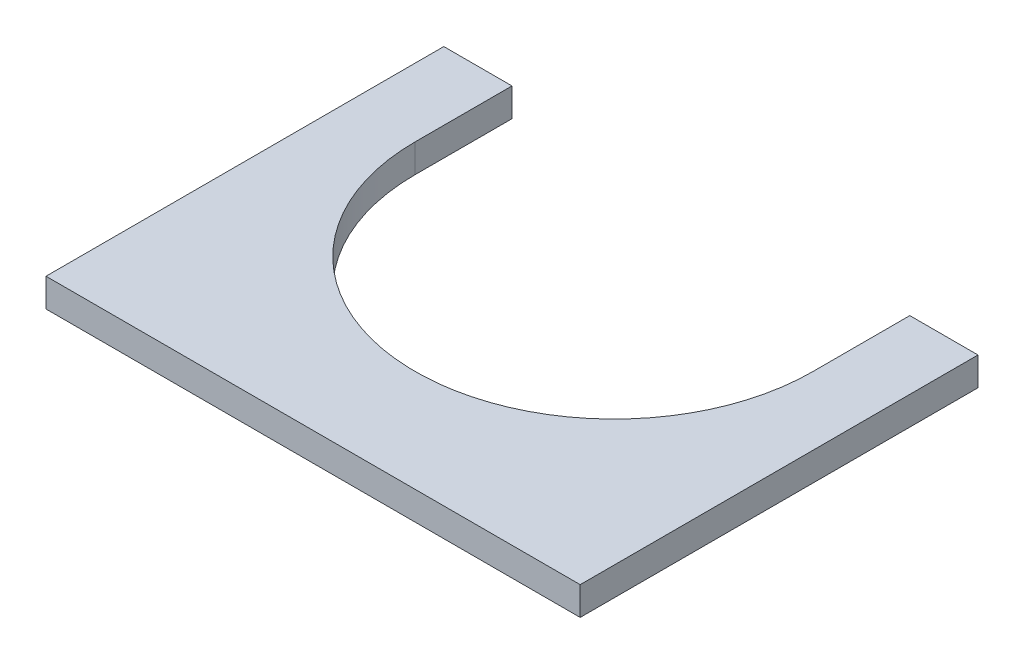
ISO-10303-21;
HEADER;
FILE_DESCRIPTION(('STEP AP214'),'2;1');
FILE_NAME('part.step','',(''),(''),'','','');
FILE_SCHEMA(('AUTOMOTIVE_DESIGN { 1 0 10303 214 1 1 1 1 }'));
ENDSEC;
DATA;
#1=APPLICATION_CONTEXT('core data for automotive mechanical design processes');
#2=APPLICATION_PROTOCOL_DEFINITION('international standard','automotive_design',2000,#1);
#3=PRODUCT_CONTEXT('',#1,'mechanical');
#4=PRODUCT('Part','Part','',(#3));
#5=PRODUCT_RELATED_PRODUCT_CATEGORY('part','',(#4));
#6=PRODUCT_DEFINITION_FORMATION('','',#4);
#7=PRODUCT_DEFINITION_CONTEXT('part definition',#1,'design');
#8=PRODUCT_DEFINITION('design','',#6,#7);
#9=PRODUCT_DEFINITION_SHAPE('','',#8);
#10=(LENGTH_UNIT() NAMED_UNIT(*) SI_UNIT(.MILLI.,.METRE.));
#11=(NAMED_UNIT(*) PLANE_ANGLE_UNIT() SI_UNIT($,.RADIAN.));
#12=(NAMED_UNIT(*) SI_UNIT($,.STERADIAN.) SOLID_ANGLE_UNIT());
#13=UNCERTAINTY_MEASURE_WITH_UNIT(LENGTH_MEASURE(1.E-05),#10,'distance_accuracy_value','');
#14=(GEOMETRIC_REPRESENTATION_CONTEXT(3) GLOBAL_UNCERTAINTY_ASSIGNED_CONTEXT((#13)) GLOBAL_UNIT_ASSIGNED_CONTEXT((#10,
#11,#12)) REPRESENTATION_CONTEXT('',''));
#15=CARTESIAN_POINT('',(0.,0.,0.));
#16=DIRECTION('',(0.,0.,1.));
#17=DIRECTION('',(1.,0.,0.));
#18=AXIS2_PLACEMENT_3D('',#15,#16,#17);
#19=CARTESIAN_POINT('',(47.,-5.,-12.5000000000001));
#20=DIRECTION('',(1.,0.,0.));
#21=DIRECTION('',(0.,0.,-1.));
#22=AXIS2_PLACEMENT_3D('',#19,#20,#21);
#23=PLANE('',#22);
#24=DIRECTION('',(0.,0.,-1.));
#25=VECTOR('',#24,1.);
#26=CARTESIAN_POINT('',(47.,0.,-12.5000000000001));
#27=LINE('',#26,#25);
#28=CARTESIAN_POINT('',(47.,0.,57.5));
#29=VERTEX_POINT('',#28);
#30=CARTESIAN_POINT('',(47.,0.,-12.5000000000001));
#31=VERTEX_POINT('',#30);
#32=EDGE_CURVE('E131',#29,#31,#27,.T.);
#33=ORIENTED_EDGE('',*,*,#32,.F.);
#34=DIRECTION('',(0.,1.,0.));
#35=VECTOR('',#34,1.);
#36=CARTESIAN_POINT('',(47.,-5.,57.5));
#37=LINE('',#36,#35);
#38=CARTESIAN_POINT('',(47.,-5.,57.5));
#39=VERTEX_POINT('',#38);
#40=EDGE_CURVE('E11',#39,#29,#37,.T.);
#41=ORIENTED_EDGE('',*,*,#40,.F.);
#42=DIRECTION('',(0.,0.,-1.));
#43=VECTOR('',#42,1.);
#44=CARTESIAN_POINT('',(47.,-5.,-12.5000000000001));
#45=LINE('',#44,#43);
#46=CARTESIAN_POINT('',(47.,-5.,-12.5000000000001));
#47=VERTEX_POINT('',#46);
#48=EDGE_CURVE('E151',#39,#47,#45,.T.);
#49=ORIENTED_EDGE('',*,*,#48,.T.);
#50=DIRECTION('',(0.,1.,0.));
#51=VECTOR('',#50,1.);
#52=CARTESIAN_POINT('',(47.,-5.,-12.5000000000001));
#53=LINE('',#52,#51);
#54=EDGE_CURVE('E37',#47,#31,#53,.T.);
#55=ORIENTED_EDGE('',*,*,#54,.T.);
#56=EDGE_LOOP('',(#33,#41,#49,#55));
#57=FACE_BOUND('',#56,.T.);
#58=ADVANCED_FACE('F34',(#57),#23,.T.);
#59=CARTESIAN_POINT('',(-47.,-5.,57.5));
#60=DIRECTION('',(0.,0.,1.));
#61=DIRECTION('',(1.,0.,0.));
#62=AXIS2_PLACEMENT_3D('',#59,#60,#61);
#63=PLANE('',#62);
#64=DIRECTION('',(1.,0.,0.));
#65=VECTOR('',#64,1.);
#66=CARTESIAN_POINT('',(-47.,0.,57.5));
#67=LINE('',#66,#65);
#68=CARTESIAN_POINT('',(-47.,0.,57.5));
#69=VERTEX_POINT('',#68);
#70=EDGE_CURVE('E149',#69,#29,#67,.T.);
#71=ORIENTED_EDGE('',*,*,#70,.F.);
#72=DIRECTION('',(0.,1.,0.));
#73=VECTOR('',#72,1.);
#74=CARTESIAN_POINT('',(-47.,-5.,57.5));
#75=LINE('',#74,#73);
#76=CARTESIAN_POINT('',(-47.,-5.,57.5));
#77=VERTEX_POINT('',#76);
#78=EDGE_CURVE('E43',#77,#69,#75,.T.);
#79=ORIENTED_EDGE('',*,*,#78,.F.);
#80=DIRECTION('',(1.,0.,0.));
#81=VECTOR('',#80,1.);
#82=CARTESIAN_POINT('',(-47.,-5.,57.5));
#83=LINE('',#82,#81);
#84=EDGE_CURVE('E121',#77,#39,#83,.T.);
#85=ORIENTED_EDGE('',*,*,#84,.T.);
#86=ORIENTED_EDGE('',*,*,#40,.T.);
#87=EDGE_LOOP('',(#71,#79,#85,#86));
#88=FACE_BOUND('',#87,.T.);
#89=ADVANCED_FACE('F163',(#88),#63,.T.);
#90=CARTESIAN_POINT('',(-47.,-5.,57.5));
#91=DIRECTION('',(-1.,0.,0.));
#92=DIRECTION('',(0.,0.,1.));
#93=AXIS2_PLACEMENT_3D('',#90,#91,#92);
#94=PLANE('',#93);
#95=DIRECTION('',(0.,0.,1.));
#96=VECTOR('',#95,1.);
#97=CARTESIAN_POINT('',(-47.,0.,57.5));
#98=LINE('',#97,#96);
#99=CARTESIAN_POINT('',(-47.,0.,-12.5));
#100=VERTEX_POINT('',#99);
#101=EDGE_CURVE('E108',#100,#69,#98,.T.);
#102=ORIENTED_EDGE('',*,*,#101,.F.);
#103=DIRECTION('',(0.,1.,0.));
#104=VECTOR('',#103,1.);
#105=CARTESIAN_POINT('',(-47.,-5.,-12.5));
#106=LINE('',#105,#104);
#107=CARTESIAN_POINT('',(-47.,-5.,-12.5));
#108=VERTEX_POINT('',#107);
#109=EDGE_CURVE('E103',#108,#100,#106,.T.);
#110=ORIENTED_EDGE('',*,*,#109,.F.);
#111=DIRECTION('',(0.,0.,1.));
#112=VECTOR('',#111,1.);
#113=CARTESIAN_POINT('',(-47.,-5.,57.5));
#114=LINE('',#113,#112);
#115=EDGE_CURVE('E106',#108,#77,#114,.T.);
#116=ORIENTED_EDGE('',*,*,#115,.T.);
#117=ORIENTED_EDGE('',*,*,#78,.T.);
#118=EDGE_LOOP('',(#102,#110,#116,#117));
#119=FACE_BOUND('',#118,.T.);
#120=ADVANCED_FACE('F105',(#119),#94,.T.);
#121=CARTESIAN_POINT('',(-47.,-5.,-12.5));
#122=DIRECTION('',(0.,0.,-1.));
#123=DIRECTION('',(-1.,0.,0.));
#124=AXIS2_PLACEMENT_3D('',#121,#122,#123);
#125=PLANE('',#124);
#126=DIRECTION('',(-1.,0.,0.));
#127=VECTOR('',#126,1.);
#128=CARTESIAN_POINT('',(-47.,0.,-12.5));
#129=LINE('',#128,#127);
#130=CARTESIAN_POINT('',(-35.0000000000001,0.,-12.5));
#131=VERTEX_POINT('',#130);
#132=EDGE_CURVE('E146',#131,#100,#129,.T.);
#133=ORIENTED_EDGE('',*,*,#132,.F.);
#134=DIRECTION('',(0.,1.,0.));
#135=VECTOR('',#134,1.);
#136=CARTESIAN_POINT('',(-35.0000000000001,-5.,-12.5));
#137=LINE('',#136,#135);
#138=CARTESIAN_POINT('',(-35.0000000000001,-5.,-12.5));
#139=VERTEX_POINT('',#138);
#140=EDGE_CURVE('E113',#139,#131,#137,.T.);
#141=ORIENTED_EDGE('',*,*,#140,.F.);
#142=DIRECTION('',(-1.,0.,0.));
#143=VECTOR('',#142,1.);
#144=CARTESIAN_POINT('',(-47.,-5.,-12.5));
#145=LINE('',#144,#143);
#146=EDGE_CURVE('E119',#139,#108,#145,.T.);
#147=ORIENTED_EDGE('',*,*,#146,.T.);
#148=ORIENTED_EDGE('',*,*,#109,.T.);
#149=EDGE_LOOP('',(#133,#141,#147,#148));
#150=FACE_BOUND('',#149,.T.);
#151=ADVANCED_FACE('F123',(#150),#125,.T.);
#152=CARTESIAN_POINT('',(-35.0000000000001,-5.,-12.5));
#153=DIRECTION('',(1.,0.,0.));
#154=DIRECTION('',(0.,0.,-1.));
#155=AXIS2_PLACEMENT_3D('',#152,#153,#154);
#156=PLANE('',#155);
#157=DIRECTION('',(0.,0.,-1.));
#158=VECTOR('',#157,1.);
#159=CARTESIAN_POINT('',(-35.0000000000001,0.,-12.5));
#160=LINE('',#159,#158);
#161=CARTESIAN_POINT('',(-35.0000000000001,0.,4.54537150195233));
#162=VERTEX_POINT('',#161);
#163=EDGE_CURVE('E143',#162,#131,#160,.T.);
#164=ORIENTED_EDGE('',*,*,#163,.F.);
#165=DIRECTION('',(0.,1.,0.));
#166=VECTOR('',#165,1.);
#167=CARTESIAN_POINT('',(-35.0000000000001,-5.,4.54537150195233));
#168=LINE('',#167,#166);
#169=CARTESIAN_POINT('',(-35.0000000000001,-5.,4.54537150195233));
#170=VERTEX_POINT('',#169);
#171=EDGE_CURVE('E155',#170,#162,#168,.T.);
#172=ORIENTED_EDGE('',*,*,#171,.F.);
#173=DIRECTION('',(0.,0.,-1.));
#174=VECTOR('',#173,1.);
#175=CARTESIAN_POINT('',(-35.0000000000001,-5.,-12.5));
#176=LINE('',#175,#174);
#177=EDGE_CURVE('E124',#170,#139,#176,.T.);
#178=ORIENTED_EDGE('',*,*,#177,.T.);
#179=ORIENTED_EDGE('',*,*,#140,.T.);
#180=EDGE_LOOP('',(#164,#172,#178,#179));
#181=FACE_BOUND('',#180,.T.);
#182=ADVANCED_FACE('F176',(#181),#156,.T.);
#183=CARTESIAN_POINT('',(0.,-5.,4.54537150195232));
#184=DIRECTION('',(0.,1.,0.));
#185=DIRECTION('',(0.,0.,1.));
#186=AXIS2_PLACEMENT_3D('',#183,#184,#185);
#187=CYLINDRICAL_SURFACE('',#186,35.);
#188=CARTESIAN_POINT('',(0.,0.,4.54537150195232));
#189=DIRECTION('',(0.,-1.,0.));
#190=DIRECTION('',(0.,0.,1.));
#191=AXIS2_PLACEMENT_3D('',#188,#189,#190);
#192=CIRCLE('',#191,35.);
#193=CARTESIAN_POINT('',(34.9999999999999,0.,4.54537150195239));
#194=VERTEX_POINT('',#193);
#195=EDGE_CURVE('E140',#194,#162,#192,.T.);
#196=ORIENTED_EDGE('',*,*,#195,.F.);
#197=DIRECTION('',(0.,1.,0.));
#198=VECTOR('',#197,1.);
#199=CARTESIAN_POINT('',(34.9999999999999,-5.,4.54537150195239));
#200=LINE('',#199,#198);
#201=CARTESIAN_POINT('',(34.9999999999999,-5.,4.54537150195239));
#202=VERTEX_POINT('',#201);
#203=EDGE_CURVE('E157',#202,#194,#200,.T.);
#204=ORIENTED_EDGE('',*,*,#203,.F.);
#205=CARTESIAN_POINT('',(0.,-5.,4.54537150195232));
#206=DIRECTION('',(0.,-1.,0.));
#207=DIRECTION('',(0.,0.,1.));
#208=AXIS2_PLACEMENT_3D('',#205,#206,#207);
#209=CIRCLE('',#208,35.);
#210=EDGE_CURVE('E126',#202,#170,#209,.T.);
#211=ORIENTED_EDGE('',*,*,#210,.T.);
#212=ORIENTED_EDGE('',*,*,#171,.T.);
#213=EDGE_LOOP('',(#196,#204,#211,#212));
#214=FACE_BOUND('',#213,.T.);
#215=ADVANCED_FACE('F179',(#214),#187,.F.);
#216=CARTESIAN_POINT('',(34.9999999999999,-5.,4.54537150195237));
#217=DIRECTION('',(-1.,0.,0.));
#218=DIRECTION('',(0.,0.,1.));
#219=AXIS2_PLACEMENT_3D('',#216,#217,#218);
#220=PLANE('',#219);
#221=DIRECTION('',(0.,0.,1.));
#222=VECTOR('',#221,1.);
#223=CARTESIAN_POINT('',(34.9999999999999,0.,4.54537150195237));
#224=LINE('',#223,#222);
#225=CARTESIAN_POINT('',(34.9999999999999,0.,-12.5000000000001));
#226=VERTEX_POINT('',#225);
#227=EDGE_CURVE('E137',#226,#194,#224,.T.);
#228=ORIENTED_EDGE('',*,*,#227,.F.);
#229=DIRECTION('',(0.,1.,0.));
#230=VECTOR('',#229,1.);
#231=CARTESIAN_POINT('',(34.9999999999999,-5.,-12.5000000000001));
#232=LINE('',#231,#230);
#233=CARTESIAN_POINT('',(34.9999999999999,-5.,-12.5000000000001));
#234=VERTEX_POINT('',#233);
#235=EDGE_CURVE('E158',#234,#226,#232,.T.);
#236=ORIENTED_EDGE('',*,*,#235,.F.);
#237=DIRECTION('',(0.,0.,1.));
#238=VECTOR('',#237,1.);
#239=CARTESIAN_POINT('',(34.9999999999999,-5.,4.54537150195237));
#240=LINE('',#239,#238);
#241=EDGE_CURVE('E274',#234,#202,#240,.T.);
#242=ORIENTED_EDGE('',*,*,#241,.T.);
#243=ORIENTED_EDGE('',*,*,#203,.T.);
#244=EDGE_LOOP('',(#228,#236,#242,#243));
#245=FACE_BOUND('',#244,.T.);
#246=ADVANCED_FACE('F183',(#245),#220,.T.);
#247=CARTESIAN_POINT('',(34.9999999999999,-5.,-12.5000000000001));
#248=DIRECTION('',(0.,0.,-1.));
#249=DIRECTION('',(-1.,0.,0.));
#250=AXIS2_PLACEMENT_3D('',#247,#248,#249);
#251=PLANE('',#250);
#252=DIRECTION('',(-1.,0.,0.));
#253=VECTOR('',#252,1.);
#254=CARTESIAN_POINT('',(34.9999999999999,0.,-12.5000000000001));
#255=LINE('',#254,#253);
#256=EDGE_CURVE('E134',#31,#226,#255,.T.);
#257=ORIENTED_EDGE('',*,*,#256,.F.);
#258=ORIENTED_EDGE('',*,*,#54,.F.);
#259=DIRECTION('',(-1.,0.,0.));
#260=VECTOR('',#259,1.);
#261=CARTESIAN_POINT('',(34.9999999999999,-5.,-12.5000000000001));
#262=LINE('',#261,#260);
#263=EDGE_CURVE('E275',#47,#234,#262,.T.);
#264=ORIENTED_EDGE('',*,*,#263,.T.);
#265=ORIENTED_EDGE('',*,*,#235,.T.);
#266=EDGE_LOOP('',(#257,#258,#264,#265));
#267=FACE_BOUND('',#266,.T.);
#268=ADVANCED_FACE('F160',(#267),#251,.T.);
#269=CARTESIAN_POINT('',(0.,-5.,4.54537150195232));
#270=DIRECTION('',(0.,1.,0.));
#271=DIRECTION('',(0.,0.,1.));
#272=AXIS2_PLACEMENT_3D('',#269,#270,#271);
#273=PLANE('',#272);
#274=ORIENTED_EDGE('',*,*,#48,.F.);
#275=ORIENTED_EDGE('',*,*,#84,.F.);
#276=ORIENTED_EDGE('',*,*,#115,.F.);
#277=ORIENTED_EDGE('',*,*,#146,.F.);
#278=ORIENTED_EDGE('',*,*,#177,.F.);
#279=ORIENTED_EDGE('',*,*,#210,.F.);
#280=ORIENTED_EDGE('',*,*,#241,.F.);
#281=ORIENTED_EDGE('',*,*,#263,.F.);
#282=EDGE_LOOP('',(#274,#275,#276,#277,#278,#279,#280,#281));
#283=FACE_BOUND('',#282,.T.);
#284=ADVANCED_FACE('F117',(#283),#273,.F.);
#285=CARTESIAN_POINT('',(0.,0.,4.54537150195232));
#286=DIRECTION('',(0.,1.,0.));
#287=DIRECTION('',(0.,0.,1.));
#288=AXIS2_PLACEMENT_3D('',#285,#286,#287);
#289=PLANE('',#288);
#290=ORIENTED_EDGE('',*,*,#32,.T.);
#291=ORIENTED_EDGE('',*,*,#256,.T.);
#292=ORIENTED_EDGE('',*,*,#227,.T.);
#293=ORIENTED_EDGE('',*,*,#195,.T.);
#294=ORIENTED_EDGE('',*,*,#163,.T.);
#295=ORIENTED_EDGE('',*,*,#132,.T.);
#296=ORIENTED_EDGE('',*,*,#101,.T.);
#297=ORIENTED_EDGE('',*,*,#70,.T.);
#298=EDGE_LOOP('',(#290,#291,#292,#293,#294,#295,#296,#297));
#299=FACE_BOUND('',#298,.T.);
#300=ADVANCED_FACE('F162',(#299),#289,.T.);
#301=CLOSED_SHELL('',(#58,#89,#120,#151,#182,#215,#246,#268,#284,#300));
#302=MANIFOLD_SOLID_BREP('B2',#301);
#303=ADVANCED_BREP_SHAPE_REPRESENTATION('',(#18,#302),#14);
#304=SHAPE_DEFINITION_REPRESENTATION(#9,#303);
ENDSEC;
END-ISO-10303-21;
